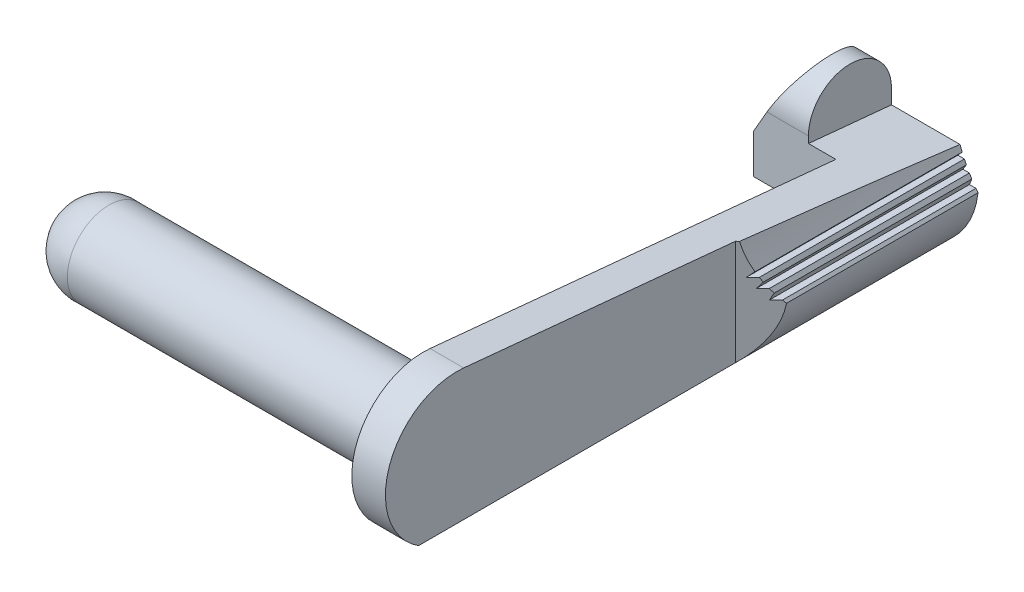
from build123d import *

# Parameters (mm, degrees)
BOSS_EXTRUDE1_DEPTH             = 2.0574
BOSS_EXTRUDE3_REACH             = 32.575
BOSS_EXTRUDE3_DIRECTION_2_DEPTH = 4.3688
BOSS_EXTRUDE6_DEPTH             = 1.6764
BOSS_EXTRUDE7_DEPTH             = 3.3528
CUT_EXTRUDE5_DEPTH              = 36.400064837
CUT_EXTRUDE6_DEPTH              = 36.400064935
CUT_EXTRUDE7_DEPTH              = 36.400064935
CUT_EXTRUDE8_DEPTH              = 3.3528
CUT_EXTRUDE8_DEPTH_BACK         = 3.3528
SKETCH21_R                      = 2.54635
BOSS_EXTRUDE9_DEPTH             = 19.2278
DOME1_FACE_RADIUS               = 2.54635
DOME1_HEIGHT                    = 2.794
CUT_EXTRUDE10_DEPTH             = 38.689325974
CUT_EXTRUDE10_DEPTH_BACK        = 38.689325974
CUT_EXTRUDE11_DEPTH             = 22.0218


with BuildPart() as part:
    # Sketch1 → Boss-Extrude1 (new body)
    with BuildSketch(Plane(origin=(0, 0, 0), x_dir=(0, 0, -1), z_dir=(1, 0, 0))):
        with BuildLine():
            Line((-25.822159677, -4.3688), (4.505440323, -4.3688))
            Line((4.505440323, -4.3688), (4.505440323, 1.468790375))
            Line((4.505440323, 1.468790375), (-25.403428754, 4.348686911))
            ThreePointArc((-25.403428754, 4.348686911), (-30.185928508, 0.209606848), (-25.822159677, -4.3688))
        make_face()
    extrude(amount=BOSS_EXTRUDE1_DEPTH)

    # Boss-Extrude3: up to this plane
    boss_extrude3_end = Plane(origin=(2.0574, 4.348686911, 25.403428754), z_dir=(0, -0.9953961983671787, 0.09584575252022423))
    # Sketch3 → Boss-Extrude3 (add, up to the surface)
    with BuildSketch(Plane(origin=(0, 0, 0), x_dir=(1, 0, 0), z_dir=(0, 1, 0)), mode=Mode.PRIVATE) as boss_extrude3_sk1:
        Polygon((2.0574, -8.767964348), (2.0574, 4.505440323), (3.646804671, 4.505440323), (3.646804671, -7.178559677), align=None)
    boss_extrude3_tool1 = split(extrude(boss_extrude3_sk1.sketch, amount=BOSS_EXTRUDE3_REACH, mode=Mode.PRIVATE), bisect_by=boss_extrude3_end, keep=Keep.BOTH, mode=Mode.PRIVATE)
    add(boss_extrude3_tool1.solids().sort_by_distance((2.835232, 0, 1.742346))[0])

    # Sketch3 → Boss-Extrude3 direction 2 (add)
    with BuildSketch(Plane(origin=(0, 0, 0), x_dir=(1, 0, 0), z_dir=(0, 1, 0))):
        Polygon((2.0574, -8.767964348), (2.0574, 4.505440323), (3.646804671, 4.505440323), (3.646804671, -7.178559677), align=None)
    extrude(amount=-BOSS_EXTRUDE3_DIRECTION_2_DEPTH)

    # Sketch10 → Boss-Extrude6 (add)
    with BuildSketch(Plane.ZY):
        Polygon((-4.505440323, 1.468790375), (-4.505440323, -1.738753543), (0.574559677, -1.472522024), (0.574559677, 1.95793874), align=None)
    extrude(amount=BOSS_EXTRUDE6_DEPTH)

    # Sketch11 → Boss-Extrude7 (add)
    with BuildSketch(Plane.ZY.offset(1.6764)):
        with BuildLine():
            Line((-4.505440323, -1.472522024), (-4.505440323, 2.3622))
            ThreePointArc((-4.505440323, 2.3622), (-1.965440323, 4.9022), (0.574559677, 2.3622))
            Line((0.574559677, 2.3622), (0.574559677, -1.472522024))
            Line((0.574559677, -1.472522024), (-4.505440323, -1.472522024))
        make_face()
    extrude(amount=BOSS_EXTRUDE7_DEPTH)

    # Sketch17 → Cut-Extrude5 (cut, through all)
    with BuildSketch(Plane(origin=(0, 0, -4.505440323), x_dir=(-1, 0, 0), z_dir=(0, 0, -1))):
        with BuildLine():
            Line((-3.646804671, 0.00213874), (-3.646804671, -4.3688))
            Line((-3.646804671, -4.3688), (-1.15549054, -4.3688))
            ThreePointArc((-1.15549054, -4.3688), (-2.980245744, -2.513400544), (-3.646804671, 0.00213874))
        make_face()
    extrude(amount=-CUT_EXTRUDE5_DEPTH, mode=Mode.SUBTRACT)

    # Sketch18 → Cut-Extrude6 (cut, through all)
    with BuildSketch(Plane(origin=(0, 0, -4.505440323), x_dir=(-1, 0, 0), z_dir=(0, 0, -1))):
        with BuildLine():
            Line((-3.646804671, 2.593831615), (-3.646804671, -0.581292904))
            ThreePointArc((-3.646804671, -0.581292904), (-2.711310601, 0.988272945), (-2.176364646, 2.735418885))
            Line((-2.176364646, 2.735418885), (-3.646804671, 2.593831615))
        make_face()
    extrude(amount=-CUT_EXTRUDE6_DEPTH, mode=Mode.SUBTRACT)

    # Sketch19 → Cut-Extrude7 (cut, through all)
    with BuildSketch(Plane(origin=(0, 0, -4.505440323), x_dir=(-1, 0, 0), z_dir=(0, 0, -1))):
        Polygon((5.0292, 0.948914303), (2.746769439, 4.9022), (5.0292, 4.9022), align=None)
    extrude(amount=-CUT_EXTRUDE7_DEPTH, mode=Mode.SUBTRACT)

    # Sketch20 → Cut-Extrude8 (cut, two sides: drawn at the far end of the back side and taken through both)
    with BuildSketch(Plane(origin=(0, 0, 0), x_dir=(1, 0, 0), z_dir=(0, 1, 0)).offset(-CUT_EXTRUDE8_DEPTH_BACK)):
        Polygon((-5.0292, 3.032240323), (-3.793038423, 4.505440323), (-4.213239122, 4.505440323), (-5.0292, 4.505440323), align=None)
    extrude(amount=CUT_EXTRUDE8_DEPTH + CUT_EXTRUDE8_DEPTH_BACK, mode=Mode.SUBTRACT)

    # Sketch21 → Boss-Extrude9 (add)
    with BuildSketch(Plane.ZY):
        with Locations(Location((25.822159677, 0, 0), (0, 0, 180))):
            Circle(SKETCH21_R)
    extrude(amount=BOSS_EXTRUDE9_DEPTH)

    # Dome1: a dome of height H over a round flat face of radius A is a cap of a sphere of radius (A * A + H * H) / (2 * H)
    dome1_r = (DOME1_FACE_RADIUS * DOME1_FACE_RADIUS + DOME1_HEIGHT * DOME1_HEIGHT) / (2 * DOME1_HEIGHT)
    dome1_base = Plane((-19.2278, 0, 25.822159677), z_dir=(-1, 0, 0))
    with Locations(dome1_base.offset(DOME1_HEIGHT - dome1_r)):
        dome1_ball = Sphere(dome1_r, mode=Mode.PRIVATE)
    add(split(dome1_ball, bisect_by=dome1_base, keep=Keep.TOP, mode=Mode.PRIVATE))

    # Sketch22 → Cut-Extrude10 (cut, two sides: drawn at the far end of the back side and taken through both)
    with BuildSketch(Plane(origin=(0, 0, 0), x_dir=(1, 0, 0), z_dir=(0, 1, 0)).offset(-CUT_EXTRUDE10_DEPTH_BACK)):
        Polygon((-3.909497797, 4.366649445), (-5.0292, 1.965440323), (-5.0292, 3.032240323), align=None)
    extrude(amount=CUT_EXTRUDE10_DEPTH + CUT_EXTRUDE10_DEPTH_BACK, mode=Mode.SUBTRACT)

    # Sketch23 → Cut-Extrude11 (cut)
    with BuildSketch(Plane(origin=(0, 0, -4.505440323), x_dir=(-1, 0, 0), z_dir=(0, 0, -1))):
        with BuildLine():
            ThreePointArc((-2.651507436, 1.126852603), (-2.71573226, 0.978318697), (-2.78309681, 0.831182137))
            Line((-2.78309681, 0.831182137), (-2.385128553, 0.831182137))
            Line((-2.385128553, 0.831182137), (-2.651507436, 1.126852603))
        make_face()
        with BuildLine():
            ThreePointArc((-2.907756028, 0.578592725), (-2.997814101, 0.409550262), (-3.092092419, 0.242824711))
            Line((-3.092092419, 0.242824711), (-2.694124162, 0.242824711))
            Line((-2.694124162, 0.242824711), (-2.907756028, 0.578592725))
        make_face()
        with BuildLine():
            ThreePointArc((-3.240730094, -0.001802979), (-3.362697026, -0.188209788), (-3.490060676, -0.370971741))
            Line((-3.490060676, -0.370971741), (-3.092092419, -0.370971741))
            Line((-3.092092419, -0.370971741), (-3.240730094, -0.001802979))
        make_face()
    extrude(amount=-CUT_EXTRUDE11_DEPTH, mode=Mode.SUBTRACT)


solid = part.part
